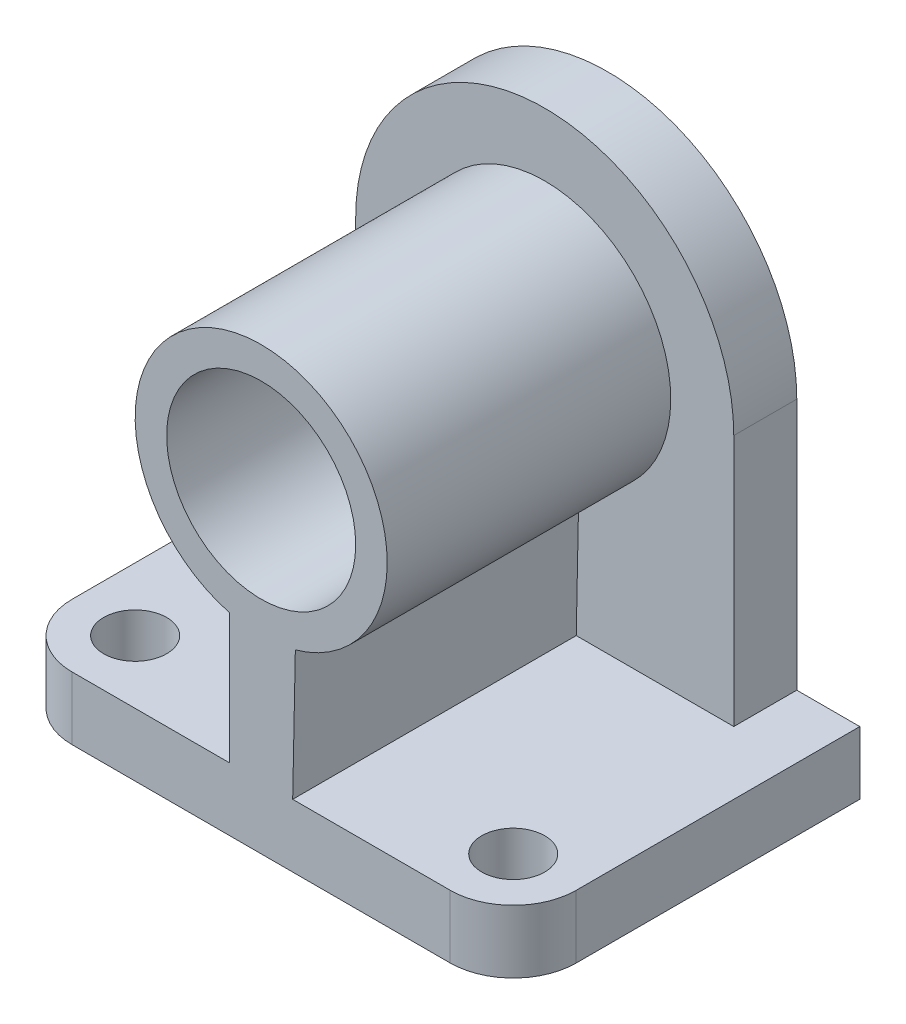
ISO-10303-21;
HEADER;
FILE_DESCRIPTION(('STEP AP214'),'2;1');
FILE_NAME('part.step','',(''),(''),'','','');
FILE_SCHEMA(('AUTOMOTIVE_DESIGN { 1 0 10303 214 1 1 1 1 }'));
ENDSEC;
DATA;
#1=APPLICATION_CONTEXT('core data for automotive mechanical design processes');
#2=APPLICATION_PROTOCOL_DEFINITION('international standard','automotive_design',2000,#1);
#3=PRODUCT_CONTEXT('',#1,'mechanical');
#4=PRODUCT('Part','Part','',(#3));
#5=PRODUCT_RELATED_PRODUCT_CATEGORY('part','',(#4));
#6=PRODUCT_DEFINITION_FORMATION('','',#4);
#7=PRODUCT_DEFINITION_CONTEXT('part definition',#1,'design');
#8=PRODUCT_DEFINITION('design','',#6,#7);
#9=PRODUCT_DEFINITION_SHAPE('','',#8);
#10=(LENGTH_UNIT() NAMED_UNIT(*) SI_UNIT(.MILLI.,.METRE.));
#11=(NAMED_UNIT(*) PLANE_ANGLE_UNIT() SI_UNIT($,.RADIAN.));
#12=(NAMED_UNIT(*) SI_UNIT($,.STERADIAN.) SOLID_ANGLE_UNIT());
#13=UNCERTAINTY_MEASURE_WITH_UNIT(LENGTH_MEASURE(1.E-05),#10,'distance_accuracy_value','');
#14=(GEOMETRIC_REPRESENTATION_CONTEXT(3) GLOBAL_UNCERTAINTY_ASSIGNED_CONTEXT((#13)) GLOBAL_UNIT_ASSIGNED_CONTEXT((#10,
#11,#12)) REPRESENTATION_CONTEXT('',''));
#15=CARTESIAN_POINT('',(0.,0.,0.));
#16=DIRECTION('',(0.,0.,1.));
#17=DIRECTION('',(1.,0.,0.));
#18=AXIS2_PLACEMENT_3D('',#15,#16,#17);
#19=CARTESIAN_POINT('',(-30.,10.,45.));
#20=DIRECTION('',(0.,-1.,0.));
#21=DIRECTION('',(0.,0.,-1.));
#22=AXIS2_PLACEMENT_3D('',#19,#20,#21);
#23=PLANE('',#22);
#24=CARTESIAN_POINT('',(-30.,10.,45.));
#25=DIRECTION('',(0.,1.,0.));
#26=DIRECTION('',(0.,0.,1.));
#27=AXIS2_PLACEMENT_3D('',#24,#25,#26);
#28=CIRCLE('',#27,5.);
#29=CARTESIAN_POINT('',(-30.,10.,50.));
#30=VERTEX_POINT('',#29);
#31=EDGE_CURVE('E233',#30,#30,#28,.T.);
#32=ORIENTED_EDGE('',*,*,#31,.F.);
#33=EDGE_LOOP('',(#32));
#34=FACE_BOUND('',#33,.T.);
#35=DIRECTION('',(0.,0.,-1.));
#36=VECTOR('',#35,1.);
#37=CARTESIAN_POINT('',(-4.99999999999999,10.,55.));
#38=LINE('',#37,#36);
#39=CARTESIAN_POINT('',(-4.99999999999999,10.,55.));
#40=VERTEX_POINT('',#39);
#41=CARTESIAN_POINT('',(-4.99999999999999,10.,10.));
#42=VERTEX_POINT('',#41);
#43=EDGE_CURVE('E142',#40,#42,#38,.T.);
#44=ORIENTED_EDGE('',*,*,#43,.T.);
#45=DIRECTION('',(1.,0.,0.));
#46=VECTOR('',#45,1.);
#47=CARTESIAN_POINT('',(-29.9999999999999,10.,10.));
#48=LINE('',#47,#46);
#49=CARTESIAN_POINT('',(-29.9999999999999,10.,10.));
#50=VERTEX_POINT('',#49);
#51=EDGE_CURVE('E173',#50,#42,#48,.T.);
#52=ORIENTED_EDGE('',*,*,#51,.F.);
#53=DIRECTION('',(0.,0.,-1.));
#54=VECTOR('',#53,1.);
#55=CARTESIAN_POINT('',(-29.9999999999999,10.,10.));
#56=LINE('',#55,#54);
#57=CARTESIAN_POINT('',(-29.9999999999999,10.,0.));
#58=VERTEX_POINT('',#57);
#59=EDGE_CURVE('E190',#50,#58,#56,.T.);
#60=ORIENTED_EDGE('',*,*,#59,.T.);
#61=DIRECTION('',(-1.,0.,0.));
#62=VECTOR('',#61,1.);
#63=CARTESIAN_POINT('',(40.,10.,0.));
#64=LINE('',#63,#62);
#65=CARTESIAN_POINT('',(-40.,10.,0.));
#66=VERTEX_POINT('',#65);
#67=EDGE_CURVE('E194',#58,#66,#64,.T.);
#68=ORIENTED_EDGE('',*,*,#67,.T.);
#69=DIRECTION('',(0.,0.,1.));
#70=VECTOR('',#69,1.);
#71=CARTESIAN_POINT('',(-40.,10.,0.));
#72=LINE('',#71,#70);
#73=CARTESIAN_POINT('',(-40.,10.,45.));
#74=VERTEX_POINT('',#73);
#75=EDGE_CURVE('E239',#66,#74,#72,.T.);
#76=ORIENTED_EDGE('',*,*,#75,.T.);
#77=CARTESIAN_POINT('',(-30.,10.,45.));
#78=DIRECTION('',(0.,1.,0.));
#79=DIRECTION('',(0.,0.,-1.));
#80=AXIS2_PLACEMENT_3D('',#77,#78,#79);
#81=CIRCLE('',#80,10.);
#82=CARTESIAN_POINT('',(-30.,10.,55.));
#83=VERTEX_POINT('',#82);
#84=EDGE_CURVE('E242',#74,#83,#81,.T.);
#85=ORIENTED_EDGE('',*,*,#84,.T.);
#86=DIRECTION('',(1.,0.,0.));
#87=VECTOR('',#86,1.);
#88=CARTESIAN_POINT('',(-30.,10.,55.));
#89=LINE('',#88,#87);
#90=EDGE_CURVE('E56',#83,#40,#89,.T.);
#91=ORIENTED_EDGE('',*,*,#90,.T.);
#92=EDGE_LOOP('',(#44,#52,#60,#68,#76,#85,#91));
#93=FACE_BOUND('',#92,.T.);
#94=ADVANCED_FACE('F31',(#34,#93),#23,.F.);
#95=CARTESIAN_POINT('',(30.,10.,45.));
#96=DIRECTION('',(0.,1.,0.));
#97=DIRECTION('',(0.,0.,-1.));
#98=AXIS2_PLACEMENT_3D('',#95,#96,#97);
#99=CIRCLE('',#98,5.);
#100=CARTESIAN_POINT('',(30.,10.,40.));
#101=VERTEX_POINT('',#100);
#102=EDGE_CURVE('E226',#101,#101,#99,.T.);
#103=ORIENTED_EDGE('',*,*,#102,.F.);
#104=EDGE_LOOP('',(#103));
#105=FACE_BOUND('',#104,.T.);
#106=DIRECTION('',(0.,0.,-1.));
#107=VECTOR('',#106,1.);
#108=CARTESIAN_POINT('',(5.00000000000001,10.,55.));
#109=LINE('',#108,#107);
#110=CARTESIAN_POINT('',(5.00000000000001,10.,55.));
#111=VERTEX_POINT('',#110);
#112=CARTESIAN_POINT('',(5.,10.,10.));
#113=VERTEX_POINT('',#112);
#114=EDGE_CURVE('E48',#111,#113,#109,.T.);
#115=ORIENTED_EDGE('',*,*,#114,.F.);
#116=CARTESIAN_POINT('',(30.,10.,55.));
#117=VERTEX_POINT('',#116);
#118=EDGE_CURVE('E245',#111,#117,#89,.T.);
#119=ORIENTED_EDGE('',*,*,#118,.T.);
#120=CARTESIAN_POINT('',(30.,10.,45.));
#121=DIRECTION('',(0.,1.,0.));
#122=DIRECTION('',(0.,0.,1.));
#123=AXIS2_PLACEMENT_3D('',#120,#121,#122);
#124=CIRCLE('',#123,10.);
#125=CARTESIAN_POINT('',(40.,10.,45.));
#126=VERTEX_POINT('',#125);
#127=EDGE_CURVE('E247',#117,#126,#124,.T.);
#128=ORIENTED_EDGE('',*,*,#127,.T.);
#129=DIRECTION('',(0.,0.,-1.));
#130=VECTOR('',#129,1.);
#131=CARTESIAN_POINT('',(40.,10.,0.));
#132=LINE('',#131,#130);
#133=CARTESIAN_POINT('',(40.,10.,0.));
#134=VERTEX_POINT('',#133);
#135=EDGE_CURVE('E249',#126,#134,#132,.T.);
#136=ORIENTED_EDGE('',*,*,#135,.T.);
#137=CARTESIAN_POINT('',(29.9999999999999,10.,0.));
#138=VERTEX_POINT('',#137);
#139=EDGE_CURVE('E254',#134,#138,#64,.T.);
#140=ORIENTED_EDGE('',*,*,#139,.T.);
#141=DIRECTION('',(0.,0.,-1.));
#142=VECTOR('',#141,1.);
#143=CARTESIAN_POINT('',(29.9999999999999,10.,10.));
#144=LINE('',#143,#142);
#145=CARTESIAN_POINT('',(29.9999999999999,10.,10.));
#146=VERTEX_POINT('',#145);
#147=EDGE_CURVE('E184',#146,#138,#144,.T.);
#148=ORIENTED_EDGE('',*,*,#147,.F.);
#149=EDGE_CURVE('E172',#113,#146,#48,.T.);
#150=ORIENTED_EDGE('',*,*,#149,.F.);
#151=EDGE_LOOP('',(#115,#119,#128,#136,#140,#148,#150));
#152=FACE_BOUND('',#151,.T.);
#153=ADVANCED_FACE('F314',(#105,#152),#23,.F.);
#154=CARTESIAN_POINT('',(0.,50.,10.));
#155=DIRECTION('',(0.,0.,-1.));
#156=DIRECTION('',(-1.,0.,0.));
#157=AXIS2_PLACEMENT_3D('',#154,#155,#156);
#158=PLANE('',#157);
#159=DIRECTION('',(0.,-1.,0.));
#160=VECTOR('',#159,1.);
#161=CARTESIAN_POINT('',(-4.99999999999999,30.6350832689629,10.));
#162=LINE('',#161,#160);
#163=CARTESIAN_POINT('',(-4.99999999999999,30.6350832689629,10.));
#164=VERTEX_POINT('',#163);
#165=EDGE_CURVE('E309',#164,#42,#162,.T.);
#166=ORIENTED_EDGE('',*,*,#165,.F.);
#167=CARTESIAN_POINT('',(0.,50.,10.));
#168=DIRECTION('',(0.,0.,1.));
#169=DIRECTION('',(1.,0.,0.));
#170=AXIS2_PLACEMENT_3D('',#167,#168,#169);
#171=CIRCLE('',#170,20.);
#172=CARTESIAN_POINT('',(5.42046546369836,30.7485441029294,10.));
#173=VERTEX_POINT('',#172);
#174=EDGE_CURVE('E157',#173,#164,#171,.T.);
#175=ORIENTED_EDGE('',*,*,#174,.F.);
#176=DIRECTION('',(0.0202606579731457,0.999794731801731,0.));
#177=VECTOR('',#176,1.);
#178=CARTESIAN_POINT('',(5.42046546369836,30.7485441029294,10.));
#179=LINE('',#178,#177);
#180=EDGE_CURVE('E154',#113,#173,#179,.T.);
#181=ORIENTED_EDGE('',*,*,#180,.F.);
#182=ORIENTED_EDGE('',*,*,#149,.T.);
#183=DIRECTION('',(0.,1.,0.));
#184=VECTOR('',#183,1.);
#185=CARTESIAN_POINT('',(29.9999999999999,10.,10.));
#186=LINE('',#185,#184);
#187=CARTESIAN_POINT('',(30.,50.,10.));
#188=VERTEX_POINT('',#187);
#189=EDGE_CURVE('E176',#146,#188,#186,.T.);
#190=ORIENTED_EDGE('',*,*,#189,.T.);
#191=CARTESIAN_POINT('',(0.,50.,10.));
#192=DIRECTION('',(0.,0.,1.));
#193=DIRECTION('',(-1.,0.,0.));
#194=AXIS2_PLACEMENT_3D('',#191,#192,#193);
#195=CIRCLE('',#194,30.);
#196=CARTESIAN_POINT('',(-30.,50.,10.));
#197=VERTEX_POINT('',#196);
#198=EDGE_CURVE('E166',#188,#197,#195,.T.);
#199=ORIENTED_EDGE('',*,*,#198,.T.);
#200=DIRECTION('',(0.,-1.,0.));
#201=VECTOR('',#200,1.);
#202=CARTESIAN_POINT('',(-30.,50.,10.));
#203=LINE('',#202,#201);
#204=EDGE_CURVE('E169',#197,#50,#203,.T.);
#205=ORIENTED_EDGE('',*,*,#204,.T.);
#206=ORIENTED_EDGE('',*,*,#51,.T.);
#207=EDGE_LOOP('',(#166,#175,#181,#182,#190,#199,#205,#206));
#208=FACE_BOUND('',#207,.T.);
#209=ADVANCED_FACE('F313',(#208),#158,.F.);
#210=CARTESIAN_POINT('',(-30.,0.,45.));
#211=DIRECTION('',(0.,-1.,0.));
#212=DIRECTION('',(0.,0.,-1.));
#213=AXIS2_PLACEMENT_3D('',#210,#211,#212);
#214=PLANE('',#213);
#215=CARTESIAN_POINT('',(-30.,0.,45.));
#216=DIRECTION('',(0.,1.,0.));
#217=DIRECTION('',(0.,0.,1.));
#218=AXIS2_PLACEMENT_3D('',#215,#216,#217);
#219=CIRCLE('',#218,5.);
#220=CARTESIAN_POINT('',(-30.,0.,50.));
#221=VERTEX_POINT('',#220);
#222=EDGE_CURVE('E231',#221,#221,#219,.T.);
#223=ORIENTED_EDGE('',*,*,#222,.T.);
#224=EDGE_LOOP('',(#223));
#225=FACE_BOUND('',#224,.T.);
#226=DIRECTION('',(0.,0.,1.));
#227=VECTOR('',#226,1.);
#228=CARTESIAN_POINT('',(-40.,0.,0.));
#229=LINE('',#228,#227);
#230=CARTESIAN_POINT('',(-40.,0.,0.));
#231=VERTEX_POINT('',#230);
#232=CARTESIAN_POINT('',(-40.,0.,45.));
#233=VERTEX_POINT('',#232);
#234=EDGE_CURVE('E236',#231,#233,#229,.T.);
#235=ORIENTED_EDGE('',*,*,#234,.F.);
#236=DIRECTION('',(-1.,0.,0.));
#237=VECTOR('',#236,1.);
#238=CARTESIAN_POINT('',(40.,0.,0.));
#239=LINE('',#238,#237);
#240=CARTESIAN_POINT('',(40.,0.,0.));
#241=VERTEX_POINT('',#240);
#242=EDGE_CURVE('E243',#241,#231,#239,.T.);
#243=ORIENTED_EDGE('',*,*,#242,.F.);
#244=DIRECTION('',(0.,0.,-1.));
#245=VECTOR('',#244,1.);
#246=CARTESIAN_POINT('',(40.,0.,0.));
#247=LINE('',#246,#245);
#248=CARTESIAN_POINT('',(40.,0.,45.));
#249=VERTEX_POINT('',#248);
#250=EDGE_CURVE('E271',#249,#241,#247,.T.);
#251=ORIENTED_EDGE('',*,*,#250,.F.);
#252=CARTESIAN_POINT('',(30.,0.,45.));
#253=DIRECTION('',(0.,1.,0.));
#254=DIRECTION('',(0.,0.,1.));
#255=AXIS2_PLACEMENT_3D('',#252,#253,#254);
#256=CIRCLE('',#255,10.);
#257=CARTESIAN_POINT('',(30.,0.,55.));
#258=VERTEX_POINT('',#257);
#259=EDGE_CURVE('E273',#258,#249,#256,.T.);
#260=ORIENTED_EDGE('',*,*,#259,.F.);
#261=DIRECTION('',(1.,0.,0.));
#262=VECTOR('',#261,1.);
#263=CARTESIAN_POINT('',(-30.,0.,55.));
#264=LINE('',#263,#262);
#265=CARTESIAN_POINT('',(-30.,0.,55.));
#266=VERTEX_POINT('',#265);
#267=EDGE_CURVE('E275',#266,#258,#264,.T.);
#268=ORIENTED_EDGE('',*,*,#267,.F.);
#269=CARTESIAN_POINT('',(-30.,0.,45.));
#270=DIRECTION('',(0.,1.,0.));
#271=DIRECTION('',(0.,0.,-1.));
#272=AXIS2_PLACEMENT_3D('',#269,#270,#271);
#273=CIRCLE('',#272,10.);
#274=EDGE_CURVE('E276',#233,#266,#273,.T.);
#275=ORIENTED_EDGE('',*,*,#274,.F.);
#276=EDGE_LOOP('',(#235,#243,#251,#260,#268,#275));
#277=FACE_BOUND('',#276,.T.);
#278=CARTESIAN_POINT('',(30.,0.,45.));
#279=DIRECTION('',(0.,1.,0.));
#280=DIRECTION('',(0.,0.,-1.));
#281=AXIS2_PLACEMENT_3D('',#278,#279,#280);
#282=CIRCLE('',#281,5.);
#283=CARTESIAN_POINT('',(30.,0.,40.));
#284=VERTEX_POINT('',#283);
#285=EDGE_CURVE('E224',#284,#284,#282,.T.);
#286=ORIENTED_EDGE('',*,*,#285,.T.);
#287=EDGE_LOOP('',(#286));
#288=FACE_BOUND('',#287,.T.);
#289=ADVANCED_FACE('F286',(#225,#277,#288),#214,.T.);
#290=CARTESIAN_POINT('',(-40.,10.,0.));
#291=DIRECTION('',(1.,0.,0.));
#292=DIRECTION('',(0.,0.,-1.));
#293=AXIS2_PLACEMENT_3D('',#290,#291,#292);
#294=PLANE('',#293);
#295=ORIENTED_EDGE('',*,*,#234,.T.);
#296=DIRECTION('',(0.,-1.,0.));
#297=VECTOR('',#296,1.);
#298=CARTESIAN_POINT('',(-40.,10.,45.));
#299=LINE('',#298,#297);
#300=EDGE_CURVE('E11',#74,#233,#299,.T.);
#301=ORIENTED_EDGE('',*,*,#300,.F.);
#302=ORIENTED_EDGE('',*,*,#75,.F.);
#303=DIRECTION('',(0.,-1.,0.));
#304=VECTOR('',#303,1.);
#305=CARTESIAN_POINT('',(-40.,10.,0.));
#306=LINE('',#305,#304);
#307=EDGE_CURVE('E255',#66,#231,#306,.T.);
#308=ORIENTED_EDGE('',*,*,#307,.T.);
#309=EDGE_LOOP('',(#295,#301,#302,#308));
#310=FACE_BOUND('',#309,.T.);
#311=ADVANCED_FACE('F33',(#310),#294,.F.);
#312=CARTESIAN_POINT('',(-30.,10.,45.));
#313=DIRECTION('',(0.,-1.,0.));
#314=DIRECTION('',(0.,0.,-1.));
#315=AXIS2_PLACEMENT_3D('',#312,#313,#314);
#316=CYLINDRICAL_SURFACE('',#315,10.);
#317=ORIENTED_EDGE('',*,*,#274,.T.);
#318=DIRECTION('',(0.,-1.,0.));
#319=VECTOR('',#318,1.);
#320=CARTESIAN_POINT('',(-30.,10.,55.));
#321=LINE('',#320,#319);
#322=EDGE_CURVE('E40',#83,#266,#321,.T.);
#323=ORIENTED_EDGE('',*,*,#322,.F.);
#324=ORIENTED_EDGE('',*,*,#84,.F.);
#325=ORIENTED_EDGE('',*,*,#300,.T.);
#326=EDGE_LOOP('',(#317,#323,#324,#325));
#327=FACE_BOUND('',#326,.T.);
#328=ADVANCED_FACE('F290',(#327),#316,.T.);
#329=CARTESIAN_POINT('',(-30.,10.,55.));
#330=DIRECTION('',(0.,0.,-1.));
#331=DIRECTION('',(-1.,0.,0.));
#332=AXIS2_PLACEMENT_3D('',#329,#330,#331);
#333=PLANE('',#332);
#334=ORIENTED_EDGE('',*,*,#267,.T.);
#335=DIRECTION('',(0.,-1.,0.));
#336=VECTOR('',#335,1.);
#337=CARTESIAN_POINT('',(30.,10.,55.));
#338=LINE('',#337,#336);
#339=EDGE_CURVE('E259',#117,#258,#338,.T.);
#340=ORIENTED_EDGE('',*,*,#339,.F.);
#341=ORIENTED_EDGE('',*,*,#118,.F.);
#342=DIRECTION('',(0.0202606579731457,0.999794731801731,0.));
#343=VECTOR('',#342,1.);
#344=CARTESIAN_POINT('',(5.42046546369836,30.7485441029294,55.));
#345=LINE('',#344,#343);
#346=CARTESIAN_POINT('',(5.42046546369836,30.7485441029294,55.));
#347=VERTEX_POINT('',#346);
#348=EDGE_CURVE('E144',#111,#347,#345,.T.);
#349=ORIENTED_EDGE('',*,*,#348,.T.);
#350=CARTESIAN_POINT('',(0.,50.,55.));
#351=DIRECTION('',(0.,0.,1.));
#352=DIRECTION('',(1.,0.,0.));
#353=AXIS2_PLACEMENT_3D('',#350,#351,#352);
#354=CIRCLE('',#353,20.);
#355=CARTESIAN_POINT('',(-4.99999999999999,30.6350832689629,55.));
#356=VERTEX_POINT('',#355);
#357=EDGE_CURVE('E145',#347,#356,#354,.T.);
#358=ORIENTED_EDGE('',*,*,#357,.T.);
#359=DIRECTION('',(0.,-1.,0.));
#360=VECTOR('',#359,1.);
#361=CARTESIAN_POINT('',(-4.99999999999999,30.6350832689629,55.));
#362=LINE('',#361,#360);
#363=EDGE_CURVE('E135',#356,#40,#362,.T.);
#364=ORIENTED_EDGE('',*,*,#363,.T.);
#365=ORIENTED_EDGE('',*,*,#90,.F.);
#366=ORIENTED_EDGE('',*,*,#322,.T.);
#367=EDGE_LOOP('',(#334,#340,#341,#349,#358,#364,#365,#366));
#368=FACE_BOUND('',#367,.T.);
#369=CARTESIAN_POINT('',(0.,50.,55.));
#370=DIRECTION('',(0.,0.,1.));
#371=DIRECTION('',(1.,0.,0.));
#372=AXIS2_PLACEMENT_3D('',#369,#370,#371);
#373=CIRCLE('',#372,15.);
#374=CARTESIAN_POINT('',(15.,50.,55.));
#375=VERTEX_POINT('',#374);
#376=EDGE_CURVE('E310',#375,#375,#373,.T.);
#377=ORIENTED_EDGE('',*,*,#376,.F.);
#378=EDGE_LOOP('',(#377));
#379=FACE_BOUND('',#378,.T.);
#380=ADVANCED_FACE('F148',(#368,#379),#333,.F.);
#381=CARTESIAN_POINT('',(30.,10.,45.));
#382=DIRECTION('',(0.,-1.,0.));
#383=DIRECTION('',(0.,0.,-1.));
#384=AXIS2_PLACEMENT_3D('',#381,#382,#383);
#385=CYLINDRICAL_SURFACE('',#384,10.);
#386=ORIENTED_EDGE('',*,*,#259,.T.);
#387=DIRECTION('',(0.,-1.,0.));
#388=VECTOR('',#387,1.);
#389=CARTESIAN_POINT('',(40.,10.,45.));
#390=LINE('',#389,#388);
#391=EDGE_CURVE('E262',#126,#249,#390,.T.);
#392=ORIENTED_EDGE('',*,*,#391,.F.);
#393=ORIENTED_EDGE('',*,*,#127,.F.);
#394=ORIENTED_EDGE('',*,*,#339,.T.);
#395=EDGE_LOOP('',(#386,#392,#393,#394));
#396=FACE_BOUND('',#395,.T.);
#397=ADVANCED_FACE('F298',(#396),#385,.T.);
#398=CARTESIAN_POINT('',(40.,10.,0.));
#399=DIRECTION('',(-1.,0.,0.));
#400=DIRECTION('',(0.,0.,1.));
#401=AXIS2_PLACEMENT_3D('',#398,#399,#400);
#402=PLANE('',#401);
#403=ORIENTED_EDGE('',*,*,#250,.T.);
#404=DIRECTION('',(0.,-1.,0.));
#405=VECTOR('',#404,1.);
#406=CARTESIAN_POINT('',(40.,10.,0.));
#407=LINE('',#406,#405);
#408=EDGE_CURVE('E265',#134,#241,#407,.T.);
#409=ORIENTED_EDGE('',*,*,#408,.F.);
#410=ORIENTED_EDGE('',*,*,#135,.F.);
#411=ORIENTED_EDGE('',*,*,#391,.T.);
#412=EDGE_LOOP('',(#403,#409,#410,#411));
#413=FACE_BOUND('',#412,.T.);
#414=ADVANCED_FACE('F295',(#413),#402,.F.);
#415=CARTESIAN_POINT('',(40.,10.,0.));
#416=DIRECTION('',(0.,0.,1.));
#417=DIRECTION('',(1.,0.,0.));
#418=AXIS2_PLACEMENT_3D('',#415,#416,#417);
#419=PLANE('',#418);
#420=ORIENTED_EDGE('',*,*,#242,.T.);
#421=ORIENTED_EDGE('',*,*,#307,.F.);
#422=ORIENTED_EDGE('',*,*,#67,.F.);
#423=DIRECTION('',(0.,-1.,0.));
#424=VECTOR('',#423,1.);
#425=CARTESIAN_POINT('',(-30.,50.,0.));
#426=LINE('',#425,#424);
#427=CARTESIAN_POINT('',(-30.,50.,0.));
#428=VERTEX_POINT('',#427);
#429=EDGE_CURVE('E181',#428,#58,#426,.T.);
#430=ORIENTED_EDGE('',*,*,#429,.F.);
#431=CARTESIAN_POINT('',(0.,50.,0.));
#432=DIRECTION('',(0.,0.,1.));
#433=DIRECTION('',(-1.,0.,0.));
#434=AXIS2_PLACEMENT_3D('',#431,#432,#433);
#435=CIRCLE('',#434,30.);
#436=CARTESIAN_POINT('',(30.,50.,0.));
#437=VERTEX_POINT('',#436);
#438=EDGE_CURVE('E161',#437,#428,#435,.T.);
#439=ORIENTED_EDGE('',*,*,#438,.F.);
#440=DIRECTION('',(0.,1.,0.));
#441=VECTOR('',#440,1.);
#442=CARTESIAN_POINT('',(29.9999999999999,10.,0.));
#443=LINE('',#442,#441);
#444=EDGE_CURVE('E170',#138,#437,#443,.T.);
#445=ORIENTED_EDGE('',*,*,#444,.F.);
#446=ORIENTED_EDGE('',*,*,#139,.F.);
#447=ORIENTED_EDGE('',*,*,#408,.T.);
#448=EDGE_LOOP('',(#420,#421,#422,#430,#439,#445,#446,#447));
#449=FACE_BOUND('',#448,.T.);
#450=CARTESIAN_POINT('',(0.,50.,0.));
#451=DIRECTION('',(0.,0.,1.));
#452=DIRECTION('',(1.,0.,0.));
#453=AXIS2_PLACEMENT_3D('',#450,#451,#452);
#454=CIRCLE('',#453,15.);
#455=CARTESIAN_POINT('',(15.,50.,0.));
#456=VERTEX_POINT('',#455);
#457=EDGE_CURVE('E158',#456,#456,#454,.T.);
#458=ORIENTED_EDGE('',*,*,#457,.T.);
#459=EDGE_LOOP('',(#458));
#460=FACE_BOUND('',#459,.T.);
#461=ADVANCED_FACE('F216',(#449,#460),#419,.F.);
#462=CARTESIAN_POINT('',(-30.,10.,45.));
#463=DIRECTION('',(0.,-1.,0.));
#464=DIRECTION('',(0.,0.,-1.));
#465=AXIS2_PLACEMENT_3D('',#462,#463,#464);
#466=CYLINDRICAL_SURFACE('',#465,5.);
#467=ORIENTED_EDGE('',*,*,#31,.T.);
#468=EDGE_LOOP('',(#467));
#469=FACE_BOUND('',#468,.T.);
#470=ORIENTED_EDGE('',*,*,#222,.F.);
#471=EDGE_LOOP('',(#470));
#472=FACE_BOUND('',#471,.T.);
#473=ADVANCED_FACE('F327',(#469,#472),#466,.F.);
#474=CARTESIAN_POINT('',(30.,10.,45.));
#475=DIRECTION('',(0.,-1.,0.));
#476=DIRECTION('',(0.,0.,-1.));
#477=AXIS2_PLACEMENT_3D('',#474,#475,#476);
#478=CYLINDRICAL_SURFACE('',#477,5.);
#479=ORIENTED_EDGE('',*,*,#102,.T.);
#480=EDGE_LOOP('',(#479));
#481=FACE_BOUND('',#480,.T.);
#482=ORIENTED_EDGE('',*,*,#285,.F.);
#483=EDGE_LOOP('',(#482));
#484=FACE_BOUND('',#483,.T.);
#485=ADVANCED_FACE('F409',(#481,#484),#478,.F.);
#486=CARTESIAN_POINT('',(0.,50.,10.));
#487=DIRECTION('',(0.,0.,-1.));
#488=DIRECTION('',(-1.,0.,0.));
#489=AXIS2_PLACEMENT_3D('',#486,#487,#488);
#490=CYLINDRICAL_SURFACE('',#489,30.);
#491=ORIENTED_EDGE('',*,*,#438,.T.);
#492=DIRECTION('',(0.,0.,-1.));
#493=VECTOR('',#492,1.);
#494=CARTESIAN_POINT('',(-30.,50.,10.));
#495=LINE('',#494,#493);
#496=EDGE_CURVE('E187',#197,#428,#495,.T.);
#497=ORIENTED_EDGE('',*,*,#496,.F.);
#498=ORIENTED_EDGE('',*,*,#198,.F.);
#499=DIRECTION('',(0.,0.,-1.));
#500=VECTOR('',#499,1.);
#501=CARTESIAN_POINT('',(30.,50.,10.));
#502=LINE('',#501,#500);
#503=EDGE_CURVE('E178',#188,#437,#502,.T.);
#504=ORIENTED_EDGE('',*,*,#503,.T.);
#505=EDGE_LOOP('',(#491,#497,#498,#504));
#506=FACE_BOUND('',#505,.T.);
#507=ADVANCED_FACE('F214',(#506),#490,.T.);
#508=CARTESIAN_POINT('',(-30.,50.,10.));
#509=DIRECTION('',(1.,0.,0.));
#510=DIRECTION('',(0.,1.,0.));
#511=AXIS2_PLACEMENT_3D('',#508,#509,#510);
#512=PLANE('',#511);
#513=ORIENTED_EDGE('',*,*,#429,.T.);
#514=ORIENTED_EDGE('',*,*,#59,.F.);
#515=ORIENTED_EDGE('',*,*,#204,.F.);
#516=ORIENTED_EDGE('',*,*,#496,.T.);
#517=EDGE_LOOP('',(#513,#514,#515,#516));
#518=FACE_BOUND('',#517,.T.);
#519=ADVANCED_FACE('F223',(#518),#512,.F.);
#520=CARTESIAN_POINT('',(29.9999999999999,10.,10.));
#521=DIRECTION('',(-1.,0.,0.));
#522=DIRECTION('',(0.,-1.,0.));
#523=AXIS2_PLACEMENT_3D('',#520,#521,#522);
#524=PLANE('',#523);
#525=ORIENTED_EDGE('',*,*,#444,.T.);
#526=ORIENTED_EDGE('',*,*,#503,.F.);
#527=ORIENTED_EDGE('',*,*,#189,.F.);
#528=ORIENTED_EDGE('',*,*,#147,.T.);
#529=EDGE_LOOP('',(#525,#526,#527,#528));
#530=FACE_BOUND('',#529,.T.);
#531=ADVANCED_FACE('F205',(#530),#524,.F.);
#532=CARTESIAN_POINT('',(0.,50.,10.));
#533=DIRECTION('',(0.,0.,-1.));
#534=DIRECTION('',(-1.,0.,0.));
#535=AXIS2_PLACEMENT_3D('',#532,#533,#534);
#536=CYLINDRICAL_SURFACE('',#535,15.);
#537=ORIENTED_EDGE('',*,*,#457,.F.);
#538=EDGE_LOOP('',(#537));
#539=FACE_BOUND('',#538,.T.);
#540=ORIENTED_EDGE('',*,*,#376,.T.);
#541=EDGE_LOOP('',(#540));
#542=FACE_BOUND('',#541,.T.);
#543=ADVANCED_FACE('F371',(#539,#542),#536,.F.);
#544=CARTESIAN_POINT('',(0.,50.,55.));
#545=DIRECTION('',(0.,0.,-1.));
#546=DIRECTION('',(-1.,0.,0.));
#547=AXIS2_PLACEMENT_3D('',#544,#545,#546);
#548=CYLINDRICAL_SURFACE('',#547,20.);
#549=ORIENTED_EDGE('',*,*,#174,.T.);
#550=DIRECTION('',(0.,0.,-1.));
#551=VECTOR('',#550,1.);
#552=CARTESIAN_POINT('',(-4.99999999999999,30.6350832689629,55.));
#553=LINE('',#552,#551);
#554=EDGE_CURVE('E140',#356,#164,#553,.T.);
#555=ORIENTED_EDGE('',*,*,#554,.F.);
#556=ORIENTED_EDGE('',*,*,#357,.F.);
#557=DIRECTION('',(0.,0.,-1.));
#558=VECTOR('',#557,1.);
#559=CARTESIAN_POINT('',(5.42046546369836,30.7485441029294,55.));
#560=LINE('',#559,#558);
#561=EDGE_CURVE('E304',#347,#173,#560,.T.);
#562=ORIENTED_EDGE('',*,*,#561,.T.);
#563=EDGE_LOOP('',(#549,#555,#556,#562));
#564=FACE_BOUND('',#563,.T.);
#565=ADVANCED_FACE('F156',(#564),#548,.T.);
#566=CARTESIAN_POINT('',(-4.99999999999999,30.6350832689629,55.));
#567=DIRECTION('',(1.,0.,0.));
#568=DIRECTION('',(0.,1.,0.));
#569=AXIS2_PLACEMENT_3D('',#566,#567,#568);
#570=PLANE('',#569);
#571=ORIENTED_EDGE('',*,*,#165,.T.);
#572=ORIENTED_EDGE('',*,*,#43,.F.);
#573=ORIENTED_EDGE('',*,*,#363,.F.);
#574=ORIENTED_EDGE('',*,*,#554,.T.);
#575=EDGE_LOOP('',(#571,#572,#573,#574));
#576=FACE_BOUND('',#575,.T.);
#577=ADVANCED_FACE('F138',(#576),#570,.F.);
#578=CARTESIAN_POINT('',(5.42046546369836,30.7485441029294,55.));
#579=DIRECTION('',(-0.999794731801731,0.0202606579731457,0.));
#580=DIRECTION('',(-0.0202606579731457,-0.999794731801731,0.));
#581=AXIS2_PLACEMENT_3D('',#578,#579,#580);
#582=PLANE('',#581);
#583=ORIENTED_EDGE('',*,*,#180,.T.);
#584=ORIENTED_EDGE('',*,*,#561,.F.);
#585=ORIENTED_EDGE('',*,*,#348,.F.);
#586=ORIENTED_EDGE('',*,*,#114,.T.);
#587=EDGE_LOOP('',(#583,#584,#585,#586));
#588=FACE_BOUND('',#587,.T.);
#589=ADVANCED_FACE('F303',(#588),#582,.F.);
#590=CLOSED_SHELL('',(#94,#153,#209,#289,#311,#328,#380,#397,#414,#461,#473,#485,#507,#519,#531,
#543,#565,#577,#589));
#591=MANIFOLD_SOLID_BREP('B2',#590);
#592=ADVANCED_BREP_SHAPE_REPRESENTATION('',(#18,#591),#14);
#593=SHAPE_DEFINITION_REPRESENTATION(#9,#592);
ENDSEC;
END-ISO-10303-21;
